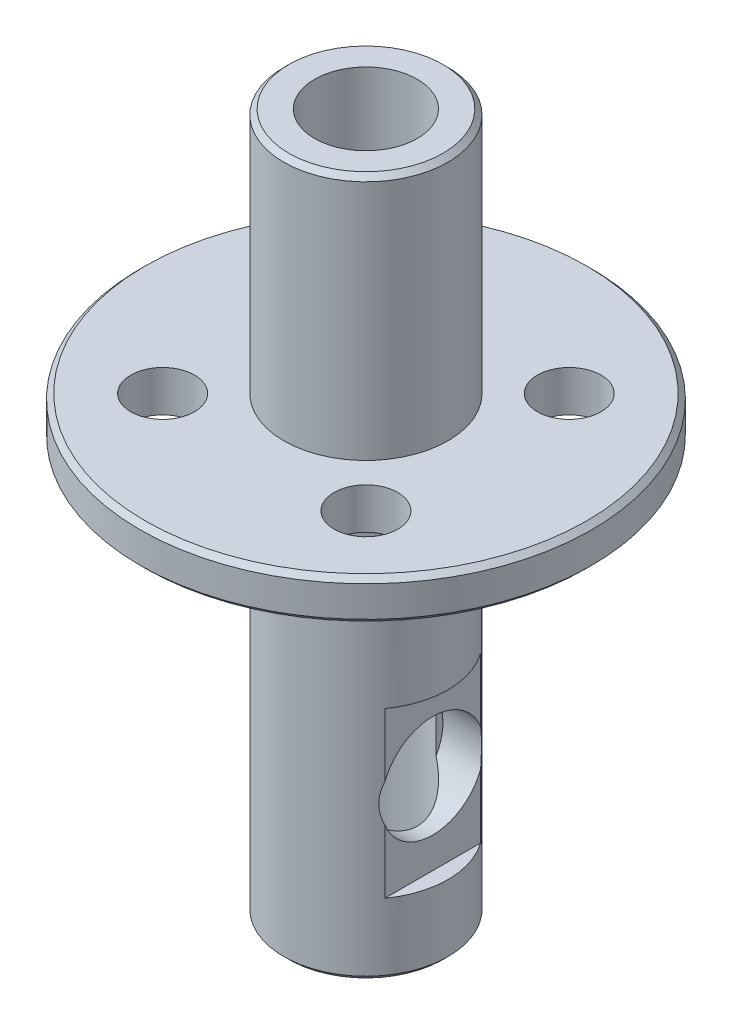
ISO-10303-21;
HEADER;
FILE_DESCRIPTION(('STEP AP214'),'2;1');
FILE_NAME('part.step','',(''),(''),'','','');
FILE_SCHEMA(('AUTOMOTIVE_DESIGN { 1 0 10303 214 1 1 1 1 }'));
ENDSEC;
DATA;
#1=APPLICATION_CONTEXT('core data for automotive mechanical design processes');
#2=APPLICATION_PROTOCOL_DEFINITION('international standard','automotive_design',2000,#1);
#3=PRODUCT_CONTEXT('',#1,'mechanical');
#4=PRODUCT('Part','Part','',(#3));
#5=PRODUCT_RELATED_PRODUCT_CATEGORY('part','',(#4));
#6=PRODUCT_DEFINITION_FORMATION('','',#4);
#7=PRODUCT_DEFINITION_CONTEXT('part definition',#1,'design');
#8=PRODUCT_DEFINITION('design','',#6,#7);
#9=PRODUCT_DEFINITION_SHAPE('','',#8);
#10=(LENGTH_UNIT() NAMED_UNIT(*) SI_UNIT(.MILLI.,.METRE.));
#11=(NAMED_UNIT(*) PLANE_ANGLE_UNIT() SI_UNIT($,.RADIAN.));
#12=(NAMED_UNIT(*) SI_UNIT($,.STERADIAN.) SOLID_ANGLE_UNIT());
#13=UNCERTAINTY_MEASURE_WITH_UNIT(LENGTH_MEASURE(1.E-05),#10,'distance_accuracy_value','');
#14=(GEOMETRIC_REPRESENTATION_CONTEXT(3) GLOBAL_UNCERTAINTY_ASSIGNED_CONTEXT((#13)) GLOBAL_UNIT_ASSIGNED_CONTEXT((#10,
#11,#12)) REPRESENTATION_CONTEXT('',''));
#15=CARTESIAN_POINT('',(0.,0.,0.));
#16=DIRECTION('',(0.,0.,1.));
#17=DIRECTION('',(1.,0.,0.));
#18=AXIS2_PLACEMENT_3D('',#15,#16,#17);
#19=CARTESIAN_POINT('',(0.,-20.,0.));
#20=DIRECTION('',(0.,1.,0.));
#21=DIRECTION('',(0.,0.,1.));
#22=AXIS2_PLACEMENT_3D('',#19,#20,#21);
#23=CYLINDRICAL_SURFACE('',#22,2.5);
#24=CARTESIAN_POINT('',(0.,14.,0.));
#25=DIRECTION('',(0.,1.,0.));
#26=DIRECTION('',(0.,0.,1.));
#27=AXIS2_PLACEMENT_3D('',#24,#25,#26);
#28=CIRCLE('',#27,2.5);
#29=CARTESIAN_POINT('',(0.,14.,2.5));
#30=VERTEX_POINT('',#29);
#31=EDGE_CURVE('E195',#30,#30,#28,.T.);
#32=ORIENTED_EDGE('',*,*,#31,.T.);
#33=EDGE_LOOP('',(#32));
#34=FACE_BOUND('',#33,.T.);
#35=CARTESIAN_POINT('',(0.,-20.,0.));
#36=DIRECTION('',(0.,1.,0.));
#37=DIRECTION('',(0.,0.,1.));
#38=AXIS2_PLACEMENT_3D('',#35,#36,#37);
#39=CIRCLE('',#38,2.5);
#40=CARTESIAN_POINT('',(0.,-20.,2.5));
#41=VERTEX_POINT('',#40);
#42=EDGE_CURVE('E189',#41,#41,#39,.T.);
#43=ORIENTED_EDGE('',*,*,#42,.F.);
#44=EDGE_LOOP('',(#43));
#45=FACE_BOUND('',#44,.T.);
#46=DIRECTION('',(0.,1.,0.));
#47=VECTOR('',#46,1.);
#48=CARTESIAN_POINT('',(1.25,-20.,-2.1650635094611));
#49=LINE('',#48,#47);
#50=CARTESIAN_POINT('',(1.25,-11.25,-2.1650635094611));
#51=VERTEX_POINT('',#50);
#52=CARTESIAN_POINT('',(1.25,-13.75,-2.1650635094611));
#53=VERTEX_POINT('',#52);
#54=EDGE_CURVE('E103',#51,#53,#49,.F.);
#55=ORIENTED_EDGE('',*,*,#54,.F.);
#56=CARTESIAN_POINT('',(0.,-12.5,0.));
#57=DIRECTION('',(-0.707106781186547,0.707106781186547,0.));
#58=DIRECTION('',(0.707106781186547,0.707106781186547,0.));
#59=AXIS2_PLACEMENT_3D('',#56,#57,#58);
#60=ELLIPSE('',#59,3.53553390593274,2.5);
#61=CARTESIAN_POINT('',(1.25,-11.25,2.1650635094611));
#62=VERTEX_POINT('',#61);
#63=EDGE_CURVE('E91',#51,#62,#60,.F.);
#64=ORIENTED_EDGE('',*,*,#63,.T.);
#65=DIRECTION('',(0.,1.,0.));
#66=VECTOR('',#65,1.);
#67=CARTESIAN_POINT('',(1.25,-20.,2.1650635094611));
#68=LINE('',#67,#66);
#69=CARTESIAN_POINT('',(1.25,-13.75,2.1650635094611));
#70=VERTEX_POINT('',#69);
#71=EDGE_CURVE('E107',#70,#62,#68,.T.);
#72=ORIENTED_EDGE('',*,*,#71,.F.);
#73=CARTESIAN_POINT('',(0.,-12.5,0.));
#74=DIRECTION('',(0.707106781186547,0.707106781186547,0.));
#75=DIRECTION('',(-0.707106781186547,0.707106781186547,0.));
#76=AXIS2_PLACEMENT_3D('',#73,#74,#75);
#77=ELLIPSE('',#76,3.53553390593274,2.5);
#78=EDGE_CURVE('E99',#70,#53,#77,.T.);
#79=ORIENTED_EDGE('',*,*,#78,.T.);
#80=EDGE_LOOP('',(#55,#64,#72,#79));
#81=FACE_BOUND('',#80,.T.);
#82=ADVANCED_FACE('F37',(#34,#45,#81),#23,.F.);
#83=CARTESIAN_POINT('',(3.25,0.,0.));
#84=DIRECTION('',(1.,0.,0.));
#85=DIRECTION('',(0.,0.,-1.));
#86=AXIS2_PLACEMENT_3D('',#83,#84,#85);
#87=PLANE('',#86);
#88=CARTESIAN_POINT('',(3.25,-12.5,0.));
#89=DIRECTION('',(1.,0.,0.));
#90=DIRECTION('',(0.,0.,-1.));
#91=AXIS2_PLACEMENT_3D('',#88,#89,#90);
#92=CIRCLE('',#91,2.5);
#93=CARTESIAN_POINT('',(3.25,-11.598612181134,-2.3318447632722));
#94=VERTEX_POINT('',#93);
#95=CARTESIAN_POINT('',(3.25,-11.598612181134,2.3318447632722));
#96=VERTEX_POINT('',#95);
#97=EDGE_CURVE('E104',#94,#96,#92,.T.);
#98=ORIENTED_EDGE('',*,*,#97,.F.);
#99=DIRECTION('',(0.,1.,0.));
#100=VECTOR('',#99,1.);
#101=CARTESIAN_POINT('',(3.25,-20.,-2.3318447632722));
#102=LINE('',#101,#100);
#103=CARTESIAN_POINT('',(3.25,-8.5,-2.3318447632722));
#104=VERTEX_POINT('',#103);
#105=EDGE_CURVE('E208',#94,#104,#102,.T.);
#106=ORIENTED_EDGE('',*,*,#105,.T.);
#107=DIRECTION('',(0.,0.,1.));
#108=VECTOR('',#107,1.);
#109=CARTESIAN_POINT('',(3.25,-8.5,-2.5));
#110=LINE('',#109,#108);
#111=CARTESIAN_POINT('',(3.25,-8.5,2.3318447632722));
#112=VERTEX_POINT('',#111);
#113=EDGE_CURVE('E227',#104,#112,#110,.T.);
#114=ORIENTED_EDGE('',*,*,#113,.T.);
#115=DIRECTION('',(0.,1.,0.));
#116=VECTOR('',#115,1.);
#117=CARTESIAN_POINT('',(3.25,-20.,2.3318447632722));
#118=LINE('',#117,#116);
#119=EDGE_CURVE('E205',#112,#96,#118,.F.);
#120=ORIENTED_EDGE('',*,*,#119,.T.);
#121=EDGE_LOOP('',(#98,#106,#114,#120));
#122=FACE_BOUND('',#121,.T.);
#123=ADVANCED_FACE('F158',(#122),#87,.T.);
#124=CARTESIAN_POINT('',(0.,2.,0.));
#125=DIRECTION('',(0.,-1.,0.));
#126=DIRECTION('',(0.,0.,-1.));
#127=AXIS2_PLACEMENT_3D('',#124,#125,#126);
#128=CYLINDRICAL_SURFACE('',#127,11.);
#129=CARTESIAN_POINT('',(0.,0.250000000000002,0.));
#130=DIRECTION('',(0.,1.,0.));
#131=DIRECTION('',(0.,0.,1.));
#132=AXIS2_PLACEMENT_3D('',#129,#130,#131);
#133=CIRCLE('',#132,11.);
#134=CARTESIAN_POINT('',(0.,0.250000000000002,11.));
#135=VERTEX_POINT('',#134);
#136=EDGE_CURVE('E140',#135,#135,#133,.T.);
#137=ORIENTED_EDGE('',*,*,#136,.T.);
#138=EDGE_LOOP('',(#137));
#139=FACE_BOUND('',#138,.T.);
#140=CARTESIAN_POINT('',(0.,1.74999999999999,0.));
#141=DIRECTION('',(0.,1.,0.));
#142=DIRECTION('',(0.,0.,1.));
#143=AXIS2_PLACEMENT_3D('',#140,#141,#142);
#144=CIRCLE('',#143,11.);
#145=CARTESIAN_POINT('',(0.,1.74999999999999,11.));
#146=VERTEX_POINT('',#145);
#147=EDGE_CURVE('E137',#146,#146,#144,.F.);
#148=ORIENTED_EDGE('',*,*,#147,.T.);
#149=EDGE_LOOP('',(#148));
#150=FACE_BOUND('',#149,.T.);
#151=ADVANCED_FACE('F154',(#139,#150),#128,.T.);
#152=CARTESIAN_POINT('',(0.,2.,0.));
#153=DIRECTION('',(0.,1.,0.));
#154=DIRECTION('',(0.,0.,1.));
#155=AXIS2_PLACEMENT_3D('',#152,#153,#154);
#156=PLANE('',#155);
#157=CARTESIAN_POINT('',(0.,2.,0.));
#158=DIRECTION('',(0.,1.,0.));
#159=DIRECTION('',(0.,0.,1.));
#160=AXIS2_PLACEMENT_3D('',#157,#158,#159);
#161=CIRCLE('',#160,10.75);
#162=CARTESIAN_POINT('',(0.,2.,10.75));
#163=VERTEX_POINT('',#162);
#164=EDGE_CURVE('E11',#163,#163,#161,.T.);
#165=ORIENTED_EDGE('',*,*,#164,.T.);
#166=EDGE_LOOP('',(#165));
#167=FACE_BOUND('',#166,.T.);
#168=CARTESIAN_POINT('',(-4.94974746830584,2.,-4.94974746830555));
#169=DIRECTION('',(0.,1.,0.));
#170=DIRECTION('',(0.,0.,1.));
#171=AXIS2_PLACEMENT_3D('',#168,#169,#170);
#172=CIRCLE('',#171,1.55000000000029);
#173=CARTESIAN_POINT('',(-4.94974746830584,2.,-3.39974746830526));
#174=VERTEX_POINT('',#173);
#175=EDGE_CURVE('E172',#174,#174,#172,.T.);
#176=ORIENTED_EDGE('',*,*,#175,.F.);
#177=EDGE_LOOP('',(#176));
#178=FACE_BOUND('',#177,.T.);
#179=CARTESIAN_POINT('',(-4.94974746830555,2.,4.94974746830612));
#180=DIRECTION('',(0.,1.,0.));
#181=DIRECTION('',(0.,0.,1.));
#182=AXIS2_PLACEMENT_3D('',#179,#180,#181);
#183=CIRCLE('',#182,1.5500000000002);
#184=CARTESIAN_POINT('',(-4.94974746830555,2.,6.49974746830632));
#185=VERTEX_POINT('',#184);
#186=EDGE_CURVE('E176',#185,#185,#183,.T.);
#187=ORIENTED_EDGE('',*,*,#186,.F.);
#188=EDGE_LOOP('',(#187));
#189=FACE_BOUND('',#188,.T.);
#190=CARTESIAN_POINT('',(4.94974746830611,2.,4.94974746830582));
#191=DIRECTION('',(0.,1.,0.));
#192=DIRECTION('',(0.,0.,1.));
#193=AXIS2_PLACEMENT_3D('',#190,#191,#192);
#194=CIRCLE('',#193,1.54999999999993);
#195=CARTESIAN_POINT('',(4.94974746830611,2.,6.49974746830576));
#196=VERTEX_POINT('',#195);
#197=EDGE_CURVE('E180',#196,#196,#194,.T.);
#198=ORIENTED_EDGE('',*,*,#197,.F.);
#199=EDGE_LOOP('',(#198));
#200=FACE_BOUND('',#199,.T.);
#201=CARTESIAN_POINT('',(4.94974746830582,2.,-4.94974746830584));
#202=DIRECTION('',(0.,1.,0.));
#203=DIRECTION('',(0.,0.,1.));
#204=AXIS2_PLACEMENT_3D('',#201,#202,#203);
#205=CIRCLE('',#204,1.55);
#206=CARTESIAN_POINT('',(4.94974746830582,2.,-3.39974746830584));
#207=VERTEX_POINT('',#206);
#208=EDGE_CURVE('E120',#207,#207,#205,.T.);
#209=ORIENTED_EDGE('',*,*,#208,.F.);
#210=EDGE_LOOP('',(#209));
#211=FACE_BOUND('',#210,.T.);
#212=CARTESIAN_POINT('',(0.,2.,0.));
#213=DIRECTION('',(0.,1.,0.));
#214=DIRECTION('',(0.,0.,1.));
#215=AXIS2_PLACEMENT_3D('',#212,#213,#214);
#216=CIRCLE('',#215,4.);
#217=CARTESIAN_POINT('',(0.,2.,4.));
#218=VERTEX_POINT('',#217);
#219=EDGE_CURVE('E186',#218,#218,#216,.T.);
#220=ORIENTED_EDGE('',*,*,#219,.F.);
#221=EDGE_LOOP('',(#220));
#222=FACE_BOUND('',#221,.T.);
#223=ADVANCED_FACE('F157',(#167,#178,#189,#200,#211,#222),#156,.T.);
#224=CARTESIAN_POINT('',(0.,0.,0.));
#225=DIRECTION('',(0.,1.,0.));
#226=DIRECTION('',(0.,0.,1.));
#227=AXIS2_PLACEMENT_3D('',#224,#225,#226);
#228=PLANE('',#227);
#229=CARTESIAN_POINT('',(0.,0.,0.));
#230=DIRECTION('',(0.,1.,0.));
#231=DIRECTION('',(0.,0.,1.));
#232=AXIS2_PLACEMENT_3D('',#229,#230,#231);
#233=CIRCLE('',#232,10.75);
#234=CARTESIAN_POINT('',(0.,0.,10.75));
#235=VERTEX_POINT('',#234);
#236=EDGE_CURVE('E46',#235,#235,#233,.F.);
#237=ORIENTED_EDGE('',*,*,#236,.T.);
#238=EDGE_LOOP('',(#237));
#239=FACE_BOUND('',#238,.T.);
#240=CARTESIAN_POINT('',(-4.94974746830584,0.,-4.94974746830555));
#241=DIRECTION('',(0.,1.,0.));
#242=DIRECTION('',(0.,0.,1.));
#243=AXIS2_PLACEMENT_3D('',#240,#241,#242);
#244=CIRCLE('',#243,1.55000000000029);
#245=CARTESIAN_POINT('',(-4.94974746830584,0.,-3.39974746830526));
#246=VERTEX_POINT('',#245);
#247=EDGE_CURVE('E126',#246,#246,#244,.T.);
#248=ORIENTED_EDGE('',*,*,#247,.T.);
#249=EDGE_LOOP('',(#248));
#250=FACE_BOUND('',#249,.T.);
#251=CARTESIAN_POINT('',(-4.94974746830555,0.,4.94974746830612));
#252=DIRECTION('',(0.,1.,0.));
#253=DIRECTION('',(0.,0.,1.));
#254=AXIS2_PLACEMENT_3D('',#251,#252,#253);
#255=CIRCLE('',#254,1.5500000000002);
#256=CARTESIAN_POINT('',(-4.94974746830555,0.,6.49974746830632));
#257=VERTEX_POINT('',#256);
#258=EDGE_CURVE('E123',#257,#257,#255,.T.);
#259=ORIENTED_EDGE('',*,*,#258,.T.);
#260=EDGE_LOOP('',(#259));
#261=FACE_BOUND('',#260,.T.);
#262=CARTESIAN_POINT('',(4.94974746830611,0.,4.94974746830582));
#263=DIRECTION('',(0.,1.,0.));
#264=DIRECTION('',(0.,0.,1.));
#265=AXIS2_PLACEMENT_3D('',#262,#263,#264);
#266=CIRCLE('',#265,1.54999999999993);
#267=CARTESIAN_POINT('',(4.94974746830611,0.,6.49974746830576));
#268=VERTEX_POINT('',#267);
#269=EDGE_CURVE('E119',#268,#268,#266,.T.);
#270=ORIENTED_EDGE('',*,*,#269,.T.);
#271=EDGE_LOOP('',(#270));
#272=FACE_BOUND('',#271,.T.);
#273=CARTESIAN_POINT('',(4.94974746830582,0.,-4.94974746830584));
#274=DIRECTION('',(0.,1.,0.));
#275=DIRECTION('',(0.,0.,1.));
#276=AXIS2_PLACEMENT_3D('',#273,#274,#275);
#277=CIRCLE('',#276,1.55);
#278=CARTESIAN_POINT('',(4.94974746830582,0.,-3.39974746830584));
#279=VERTEX_POINT('',#278);
#280=EDGE_CURVE('E116',#279,#279,#277,.T.);
#281=ORIENTED_EDGE('',*,*,#280,.T.);
#282=EDGE_LOOP('',(#281));
#283=FACE_BOUND('',#282,.T.);
#284=CARTESIAN_POINT('',(0.,0.,0.));
#285=DIRECTION('',(0.,-1.,0.));
#286=DIRECTION('',(0.,0.,-1.));
#287=AXIS2_PLACEMENT_3D('',#284,#285,#286);
#288=CIRCLE('',#287,4.);
#289=CARTESIAN_POINT('',(0.,0.,-4.));
#290=VERTEX_POINT('',#289);
#291=EDGE_CURVE('E188',#290,#290,#288,.T.);
#292=ORIENTED_EDGE('',*,*,#291,.F.);
#293=EDGE_LOOP('',(#292));
#294=FACE_BOUND('',#293,.T.);
#295=ADVANCED_FACE('F145',(#239,#250,#261,#272,#283,#294),#228,.F.);
#296=CARTESIAN_POINT('',(0.,14.,0.));
#297=DIRECTION('',(0.,-1.,0.));
#298=DIRECTION('',(0.,0.,-1.));
#299=AXIS2_PLACEMENT_3D('',#296,#297,#298);
#300=CYLINDRICAL_SURFACE('',#299,4.);
#301=CARTESIAN_POINT('',(0.,13.75,0.));
#302=DIRECTION('',(0.,1.,0.));
#303=DIRECTION('',(0.,0.,1.));
#304=AXIS2_PLACEMENT_3D('',#301,#302,#303);
#305=CIRCLE('',#304,4.);
#306=CARTESIAN_POINT('',(0.,13.75,4.));
#307=VERTEX_POINT('',#306);
#308=EDGE_CURVE('E134',#307,#307,#305,.F.);
#309=ORIENTED_EDGE('',*,*,#308,.T.);
#310=EDGE_LOOP('',(#309));
#311=FACE_BOUND('',#310,.T.);
#312=ORIENTED_EDGE('',*,*,#219,.T.);
#313=EDGE_LOOP('',(#312));
#314=FACE_BOUND('',#313,.T.);
#315=ADVANCED_FACE('F245',(#311,#314),#300,.T.);
#316=CARTESIAN_POINT('',(0.,14.,0.));
#317=DIRECTION('',(0.,1.,0.));
#318=DIRECTION('',(0.,0.,1.));
#319=AXIS2_PLACEMENT_3D('',#316,#317,#318);
#320=PLANE('',#319);
#321=CARTESIAN_POINT('',(0.,14.,0.));
#322=DIRECTION('',(0.,1.,0.));
#323=DIRECTION('',(0.,0.,1.));
#324=AXIS2_PLACEMENT_3D('',#321,#322,#323);
#325=CIRCLE('',#324,3.75000000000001);
#326=CARTESIAN_POINT('',(0.,14.,3.75000000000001));
#327=VERTEX_POINT('',#326);
#328=EDGE_CURVE('E131',#327,#327,#325,.T.);
#329=ORIENTED_EDGE('',*,*,#328,.T.);
#330=EDGE_LOOP('',(#329));
#331=FACE_BOUND('',#330,.T.);
#332=ORIENTED_EDGE('',*,*,#31,.F.);
#333=EDGE_LOOP('',(#332));
#334=FACE_BOUND('',#333,.T.);
#335=ADVANCED_FACE('F243',(#331,#334),#320,.T.);
#336=CARTESIAN_POINT('',(0.,-20.,0.));
#337=DIRECTION('',(0.,1.,0.));
#338=DIRECTION('',(0.,0.,1.));
#339=AXIS2_PLACEMENT_3D('',#336,#337,#338);
#340=CYLINDRICAL_SURFACE('',#339,4.);
#341=CARTESIAN_POINT('',(0.,-19.75,0.));
#342=DIRECTION('',(0.,-1.,0.));
#343=DIRECTION('',(0.,0.,-1.));
#344=AXIS2_PLACEMENT_3D('',#341,#342,#343);
#345=CIRCLE('',#344,4.);
#346=CARTESIAN_POINT('',(0.,-19.75,-4.));
#347=VERTEX_POINT('',#346);
#348=EDGE_CURVE('E110',#347,#347,#345,.F.);
#349=ORIENTED_EDGE('',*,*,#348,.T.);
#350=EDGE_LOOP('',(#349));
#351=FACE_BOUND('',#350,.T.);
#352=ORIENTED_EDGE('',*,*,#105,.F.);
#353=CARTESIAN_POINT('',(3.25,-11.598612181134,-2.3318447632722));
#354=CARTESIAN_POINT('',(3.23545094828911,-11.6510722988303,-2.35212058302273));
#355=CARTESIAN_POINT('',(3.22182658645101,-11.7044282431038,-2.37071160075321));
#356=CARTESIAN_POINT('',(3.19678929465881,-11.8127940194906,-2.40436642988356));
#357=CARTESIAN_POINT('',(3.18537818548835,-11.8678051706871,-2.41942733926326));
#358=CARTESIAN_POINT('',(3.15510210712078,-12.0346554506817,-2.45895458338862));
#359=CARTESIAN_POINT('',(3.14010445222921,-12.1486221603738,-2.47788667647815));
#360=CARTESIAN_POINT('',(3.12268488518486,-12.3796464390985,-2.49981057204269));
#361=CARTESIAN_POINT('',(3.12033039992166,-12.4967172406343,-2.50271691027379));
#362=CARTESIAN_POINT('',(3.12876737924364,-12.7296078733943,-2.4921581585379));
#363=CARTESIAN_POINT('',(3.13955345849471,-12.8454281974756,-2.47869977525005));
#364=CARTESIAN_POINT('',(3.16713112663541,-13.0352355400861,-2.44327392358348));
#365=CARTESIAN_POINT('',(3.18080999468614,-13.1105289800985,-2.42552215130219));
#366=CARTESIAN_POINT('',(3.21243034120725,-13.2582376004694,-2.38347754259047));
#367=CARTESIAN_POINT('',(3.23036592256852,-13.3306566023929,-2.35919374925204));
#368=CARTESIAN_POINT('',(3.25,-13.401387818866,-2.3318447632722));
#369=B_SPLINE_CURVE_WITH_KNOTS('',3,(#353,#354,#355,#356,#357,#358,#359,#360,#361,#362,#363,
#364,#365,#366,#367,#368),.UNSPECIFIED.,.F.,.F.,(4,2,2,2,2,2,2,4),(0.,0.174209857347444,
0.348562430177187,0.696242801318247,1.04577554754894,1.39516509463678,1.6304226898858,
1.86535625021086),.UNSPECIFIED.);
#370=CARTESIAN_POINT('',(3.25,-13.401387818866,-2.3318447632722));
#371=VERTEX_POINT('',#370);
#372=EDGE_CURVE('E212',#94,#371,#369,.T.);
#373=ORIENTED_EDGE('',*,*,#372,.T.);
#374=CARTESIAN_POINT('',(3.25,-16.5,-2.3318447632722));
#375=VERTEX_POINT('',#374);
#376=EDGE_CURVE('E209',#375,#371,#102,.T.);
#377=ORIENTED_EDGE('',*,*,#376,.F.);
#378=CARTESIAN_POINT('',(0.,-16.5,0.));
#379=DIRECTION('',(0.,-1.,0.));
#380=DIRECTION('',(0.,0.,-1.));
#381=AXIS2_PLACEMENT_3D('',#378,#379,#380);
#382=CIRCLE('',#381,4.);
#383=CARTESIAN_POINT('',(3.25,-16.5,2.3318447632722));
#384=VERTEX_POINT('',#383);
#385=EDGE_CURVE('E192',#375,#384,#382,.T.);
#386=ORIENTED_EDGE('',*,*,#385,.T.);
#387=CARTESIAN_POINT('',(3.25,-13.401387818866,2.3318447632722));
#388=VERTEX_POINT('',#387);
#389=EDGE_CURVE('E204',#388,#384,#118,.F.);
#390=ORIENTED_EDGE('',*,*,#389,.F.);
#391=CARTESIAN_POINT('',(3.25,-13.401387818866,2.3318447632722));
#392=CARTESIAN_POINT('',(3.23545094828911,-13.3489277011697,2.35212058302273));
#393=CARTESIAN_POINT('',(3.22182658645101,-13.2955717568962,2.37071160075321));
#394=CARTESIAN_POINT('',(3.19678929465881,-13.1872059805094,2.40436642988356));
#395=CARTESIAN_POINT('',(3.18537818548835,-13.1321948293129,2.41942733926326));
#396=CARTESIAN_POINT('',(3.15510210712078,-12.9653445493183,2.45895458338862));
#397=CARTESIAN_POINT('',(3.14010445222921,-12.8513778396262,2.47788667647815));
#398=CARTESIAN_POINT('',(3.12268488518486,-12.6203535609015,2.49981057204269));
#399=CARTESIAN_POINT('',(3.12033039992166,-12.5032827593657,2.50271691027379));
#400=CARTESIAN_POINT('',(3.12876737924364,-12.2703921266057,2.4921581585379));
#401=CARTESIAN_POINT('',(3.13955345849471,-12.1545718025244,2.47869977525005));
#402=CARTESIAN_POINT('',(3.16713112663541,-11.9647644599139,2.44327392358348));
#403=CARTESIAN_POINT('',(3.18080999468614,-11.8894710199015,2.42552215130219));
#404=CARTESIAN_POINT('',(3.21243034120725,-11.7417623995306,2.38347754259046));
#405=CARTESIAN_POINT('',(3.23036592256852,-11.6693433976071,2.35919374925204));
#406=CARTESIAN_POINT('',(3.25,-11.598612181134,2.3318447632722));
#407=B_SPLINE_CURVE_WITH_KNOTS('',3,(#391,#392,#393,#394,#395,#396,#397,#398,#399,#400,#401,
#402,#403,#404,#405,#406),.UNSPECIFIED.,.F.,.F.,(4,2,2,2,2,2,2,4),(0.,0.174209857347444,
0.348562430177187,0.696242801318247,1.04577554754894,1.39516509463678,1.63042268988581,
1.86535625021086),.UNSPECIFIED.);
#408=EDGE_CURVE('E60',#388,#96,#407,.T.);
#409=ORIENTED_EDGE('',*,*,#408,.T.);
#410=ORIENTED_EDGE('',*,*,#119,.F.);
#411=CARTESIAN_POINT('',(0.,-8.5,0.));
#412=DIRECTION('',(0.,1.,0.));
#413=DIRECTION('',(0.,0.,1.));
#414=AXIS2_PLACEMENT_3D('',#411,#412,#413);
#415=CIRCLE('',#414,4.);
#416=EDGE_CURVE('E201',#112,#104,#415,.T.);
#417=ORIENTED_EDGE('',*,*,#416,.T.);
#418=EDGE_LOOP('',(#352,#373,#377,#386,#390,#409,#410,#417));
#419=FACE_BOUND('',#418,.T.);
#420=ORIENTED_EDGE('',*,*,#291,.T.);
#421=EDGE_LOOP('',(#420));
#422=FACE_BOUND('',#421,.T.);
#423=ADVANCED_FACE('F219',(#351,#419,#422),#340,.T.);
#424=CARTESIAN_POINT('',(0.,-20.,0.));
#425=DIRECTION('',(0.,-1.,0.));
#426=DIRECTION('',(0.,0.,-1.));
#427=AXIS2_PLACEMENT_3D('',#424,#425,#426);
#428=PLANE('',#427);
#429=CARTESIAN_POINT('',(0.,-20.,0.));
#430=DIRECTION('',(0.,-1.,0.));
#431=DIRECTION('',(0.,0.,-1.));
#432=AXIS2_PLACEMENT_3D('',#429,#430,#431);
#433=CIRCLE('',#432,3.75000000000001);
#434=CARTESIAN_POINT('',(0.,-20.,-3.75000000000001));
#435=VERTEX_POINT('',#434);
#436=EDGE_CURVE('E106',#435,#435,#433,.T.);
#437=ORIENTED_EDGE('',*,*,#436,.T.);
#438=EDGE_LOOP('',(#437));
#439=FACE_BOUND('',#438,.T.);
#440=ORIENTED_EDGE('',*,*,#42,.T.);
#441=EDGE_LOOP('',(#440));
#442=FACE_BOUND('',#441,.T.);
#443=ADVANCED_FACE('F252',(#439,#442),#428,.T.);
#444=CARTESIAN_POINT('',(3.25,-8.5,-2.5));
#445=DIRECTION('',(0.,1.,0.));
#446=DIRECTION('',(0.,0.,1.));
#447=AXIS2_PLACEMENT_3D('',#444,#445,#446);
#448=PLANE('',#447);
#449=ORIENTED_EDGE('',*,*,#113,.F.);
#450=ORIENTED_EDGE('',*,*,#416,.F.);
#451=EDGE_LOOP('',(#449,#450));
#452=FACE_BOUND('',#451,.T.);
#453=ADVANCED_FACE('F268',(#452),#448,.F.);
#454=CARTESIAN_POINT('',(3.25,-16.5,-2.5));
#455=DIRECTION('',(0.,-1.,0.));
#456=DIRECTION('',(0.,0.,-1.));
#457=AXIS2_PLACEMENT_3D('',#454,#455,#456);
#458=PLANE('',#457);
#459=DIRECTION('',(0.,0.,-1.));
#460=VECTOR('',#459,1.);
#461=CARTESIAN_POINT('',(3.25,-16.5,-2.5));
#462=LINE('',#461,#460);
#463=EDGE_CURVE('E221',#384,#375,#462,.T.);
#464=ORIENTED_EDGE('',*,*,#463,.F.);
#465=ORIENTED_EDGE('',*,*,#385,.F.);
#466=EDGE_LOOP('',(#464,#465));
#467=FACE_BOUND('',#466,.T.);
#468=ADVANCED_FACE('F265',(#467),#458,.F.);
#469=CARTESIAN_POINT('',(3.25,-12.5,0.));
#470=DIRECTION('',(1.,0.,0.));
#471=DIRECTION('',(0.,0.,-1.));
#472=AXIS2_PLACEMENT_3D('',#469,#470,#471);
#473=CIRCLE('',#472,2.5);
#474=EDGE_CURVE('E112',#388,#371,#473,.T.);
#475=ORIENTED_EDGE('',*,*,#474,.F.);
#476=ORIENTED_EDGE('',*,*,#389,.T.);
#477=ORIENTED_EDGE('',*,*,#463,.T.);
#478=ORIENTED_EDGE('',*,*,#376,.T.);
#479=EDGE_LOOP('',(#475,#476,#477,#478));
#480=FACE_BOUND('',#479,.T.);
#481=ADVANCED_FACE('F224',(#480),#87,.T.);
#482=CARTESIAN_POINT('',(1.25,-12.5,0.));
#483=DIRECTION('',(1.,0.,0.));
#484=DIRECTION('',(0.,0.,-1.));
#485=AXIS2_PLACEMENT_3D('',#482,#483,#484);
#486=PLANE('',#485);
#487=ORIENTED_EDGE('',*,*,#54,.T.);
#488=CARTESIAN_POINT('',(1.25,-12.5,0.));
#489=DIRECTION('',(1.,0.,0.));
#490=DIRECTION('',(0.,0.,-1.));
#491=AXIS2_PLACEMENT_3D('',#488,#489,#490);
#492=CIRCLE('',#491,2.5);
#493=EDGE_CURVE('E94',#53,#51,#492,.T.);
#494=ORIENTED_EDGE('',*,*,#493,.T.);
#495=EDGE_LOOP('',(#487,#494));
#496=FACE_BOUND('',#495,.T.);
#497=ADVANCED_FACE('F102',(#496),#486,.T.);
#498=ORIENTED_EDGE('',*,*,#71,.T.);
#499=EDGE_CURVE('E52',#62,#70,#492,.T.);
#500=ORIENTED_EDGE('',*,*,#499,.T.);
#501=EDGE_LOOP('',(#498,#500));
#502=FACE_BOUND('',#501,.T.);
#503=ADVANCED_FACE('F281',(#502),#486,.T.);
#504=CARTESIAN_POINT('',(1.25,-12.5,0.));
#505=DIRECTION('',(1.,0.,0.));
#506=DIRECTION('',(0.,0.,-1.));
#507=AXIS2_PLACEMENT_3D('',#504,#505,#506);
#508=CYLINDRICAL_SURFACE('',#507,2.5);
#509=ORIENTED_EDGE('',*,*,#499,.F.);
#510=ORIENTED_EDGE('',*,*,#63,.F.);
#511=ORIENTED_EDGE('',*,*,#493,.F.);
#512=ORIENTED_EDGE('',*,*,#78,.F.);
#513=EDGE_LOOP('',(#509,#510,#511,#512));
#514=FACE_BOUND('',#513,.T.);
#515=ORIENTED_EDGE('',*,*,#97,.T.);
#516=ORIENTED_EDGE('',*,*,#408,.F.);
#517=ORIENTED_EDGE('',*,*,#474,.T.);
#518=ORIENTED_EDGE('',*,*,#372,.F.);
#519=EDGE_LOOP('',(#515,#516,#517,#518));
#520=FACE_BOUND('',#519,.T.);
#521=ADVANCED_FACE('F93',(#514,#520),#508,.F.);
#522=CARTESIAN_POINT('',(4.94974746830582,-20.,-4.94974746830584));
#523=DIRECTION('',(0.,1.,0.));
#524=DIRECTION('',(0.,0.,1.));
#525=AXIS2_PLACEMENT_3D('',#522,#523,#524);
#526=CYLINDRICAL_SURFACE('',#525,1.55);
#527=ORIENTED_EDGE('',*,*,#208,.T.);
#528=EDGE_LOOP('',(#527));
#529=FACE_BOUND('',#528,.T.);
#530=ORIENTED_EDGE('',*,*,#280,.F.);
#531=EDGE_LOOP('',(#530));
#532=FACE_BOUND('',#531,.T.);
#533=ADVANCED_FACE('F280',(#529,#532),#526,.F.);
#534=CARTESIAN_POINT('',(4.94974746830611,-20.,4.94974746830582));
#535=DIRECTION('',(0.,1.,0.));
#536=DIRECTION('',(0.,0.,1.));
#537=AXIS2_PLACEMENT_3D('',#534,#535,#536);
#538=CYLINDRICAL_SURFACE('',#537,1.54999999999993);
#539=ORIENTED_EDGE('',*,*,#197,.T.);
#540=EDGE_LOOP('',(#539));
#541=FACE_BOUND('',#540,.T.);
#542=ORIENTED_EDGE('',*,*,#269,.F.);
#543=EDGE_LOOP('',(#542));
#544=FACE_BOUND('',#543,.T.);
#545=ADVANCED_FACE('F298',(#541,#544),#538,.F.);
#546=CARTESIAN_POINT('',(-4.94974746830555,-20.,4.94974746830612));
#547=DIRECTION('',(0.,1.,0.));
#548=DIRECTION('',(0.,0.,1.));
#549=AXIS2_PLACEMENT_3D('',#546,#547,#548);
#550=CYLINDRICAL_SURFACE('',#549,1.5500000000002);
#551=ORIENTED_EDGE('',*,*,#186,.T.);
#552=EDGE_LOOP('',(#551));
#553=FACE_BOUND('',#552,.T.);
#554=ORIENTED_EDGE('',*,*,#258,.F.);
#555=EDGE_LOOP('',(#554));
#556=FACE_BOUND('',#555,.T.);
#557=ADVANCED_FACE('F301',(#553,#556),#550,.F.);
#558=CARTESIAN_POINT('',(-4.94974746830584,-20.,-4.94974746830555));
#559=DIRECTION('',(0.,1.,0.));
#560=DIRECTION('',(0.,0.,1.));
#561=AXIS2_PLACEMENT_3D('',#558,#559,#560);
#562=CYLINDRICAL_SURFACE('',#561,1.55000000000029);
#563=ORIENTED_EDGE('',*,*,#175,.T.);
#564=EDGE_LOOP('',(#563));
#565=FACE_BOUND('',#564,.T.);
#566=ORIENTED_EDGE('',*,*,#247,.F.);
#567=EDGE_LOOP('',(#566));
#568=FACE_BOUND('',#567,.T.);
#569=ADVANCED_FACE('F317',(#565,#568),#562,.F.);
#570=CARTESIAN_POINT('',(0.,-20.,0.));
#571=DIRECTION('',(0.,1.,0.));
#572=DIRECTION('',(0.,0.,1.));
#573=AXIS2_PLACEMENT_3D('',#570,#571,#572);
#574=CONICAL_SURFACE('',#573,3.75000000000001,0.785398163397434);
#575=ORIENTED_EDGE('',*,*,#348,.F.);
#576=EDGE_LOOP('',(#575));
#577=FACE_BOUND('',#576,.T.);
#578=ORIENTED_EDGE('',*,*,#436,.F.);
#579=EDGE_LOOP('',(#578));
#580=FACE_BOUND('',#579,.T.);
#581=ADVANCED_FACE('F320',(#577,#580),#574,.T.);
#582=CARTESIAN_POINT('',(0.,14.,0.));
#583=DIRECTION('',(0.,-1.,0.));
#584=DIRECTION('',(0.,0.,-1.));
#585=AXIS2_PLACEMENT_3D('',#582,#583,#584);
#586=CONICAL_SURFACE('',#585,3.75000000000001,0.785398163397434);
#587=ORIENTED_EDGE('',*,*,#308,.F.);
#588=EDGE_LOOP('',(#587));
#589=FACE_BOUND('',#588,.T.);
#590=ORIENTED_EDGE('',*,*,#328,.F.);
#591=EDGE_LOOP('',(#590));
#592=FACE_BOUND('',#591,.T.);
#593=ADVANCED_FACE('F151',(#589,#592),#586,.T.);
#594=CARTESIAN_POINT('',(0.,0.250000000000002,0.));
#595=DIRECTION('',(0.,1.,0.));
#596=DIRECTION('',(0.,0.,1.));
#597=AXIS2_PLACEMENT_3D('',#594,#595,#596);
#598=CONICAL_SURFACE('',#597,11.,0.785398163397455);
#599=ORIENTED_EDGE('',*,*,#236,.F.);
#600=EDGE_LOOP('',(#599));
#601=FACE_BOUND('',#600,.T.);
#602=ORIENTED_EDGE('',*,*,#136,.F.);
#603=EDGE_LOOP('',(#602));
#604=FACE_BOUND('',#603,.T.);
#605=ADVANCED_FACE('F148',(#601,#604),#598,.T.);
#606=CARTESIAN_POINT('',(0.,2.,0.));
#607=DIRECTION('',(0.,-1.,0.));
#608=DIRECTION('',(0.,0.,-1.));
#609=AXIS2_PLACEMENT_3D('',#606,#607,#608);
#610=CONICAL_SURFACE('',#609,10.75,0.785398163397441);
#611=ORIENTED_EDGE('',*,*,#147,.F.);
#612=EDGE_LOOP('',(#611));
#613=FACE_BOUND('',#612,.T.);
#614=ORIENTED_EDGE('',*,*,#164,.F.);
#615=EDGE_LOOP('',(#614));
#616=FACE_BOUND('',#615,.T.);
#617=ADVANCED_FACE('F40',(#613,#616),#610,.T.);
#618=CLOSED_SHELL('',(#82,#123,#151,#223,#295,#315,#335,#423,#443,#453,#468,#481,#497,#503,#521,
#533,#545,#557,#569,#581,#593,#605,#617));
#619=MANIFOLD_SOLID_BREP('B2',#618);
#620=ADVANCED_BREP_SHAPE_REPRESENTATION('',(#18,#619),#14);
#621=SHAPE_DEFINITION_REPRESENTATION(#9,#620);
ENDSEC;
END-ISO-10303-21;
